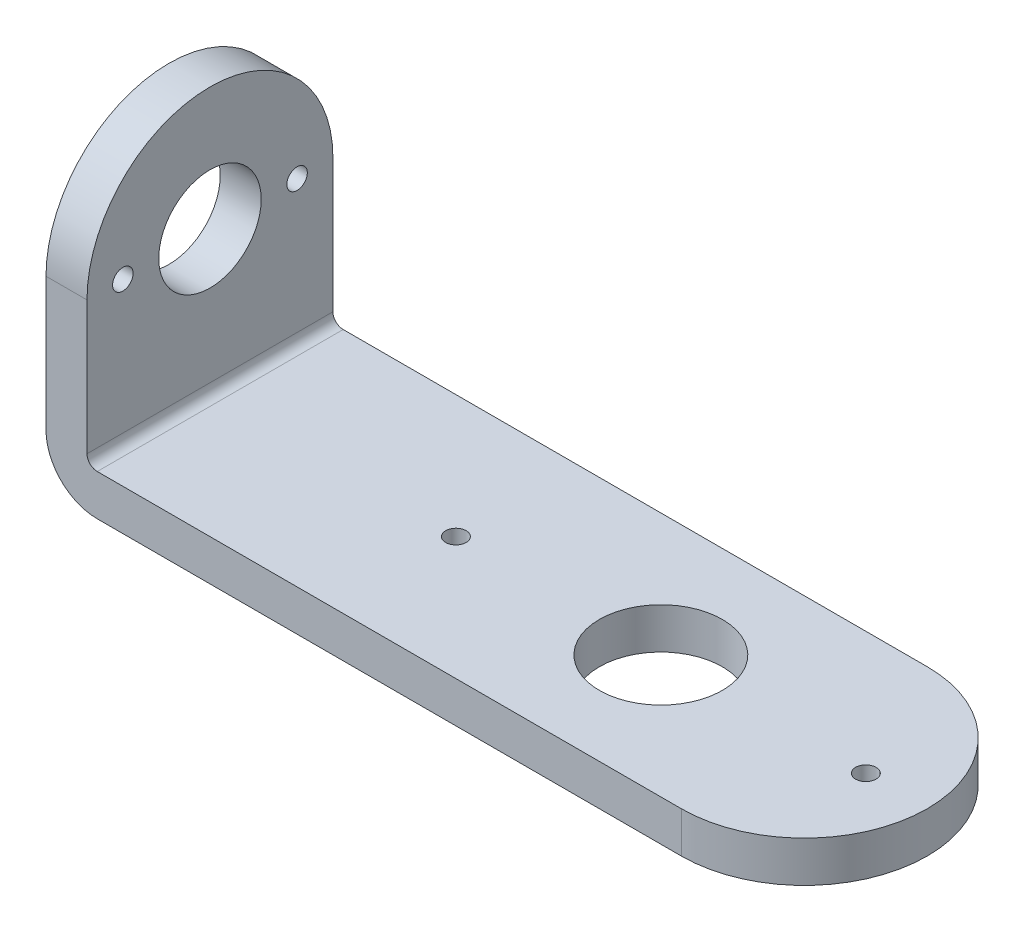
from build123d import *

# Parameters (mm, degrees)
EXTRU_MINCE1_DEPTH      = 6
ESQUISSE2_R             = 2.5
ESQUISSE2_R_2           = 0.5
ENL_V_MAT_EXTRU_1_DEPTH = 38.815340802
ESQUISSE3_R             = 0.5
ESQUISSE3_R_2           = 3
ENL_V_MAT_EXTRU_2_DEPTH = 40.67366885


with BuildPart() as part:
    # Esquisse1 → Extru.-Mince1 (new, symmetric)
    with BuildSketch(Plane.XY):
        with BuildLine():
            Line((0, 0), (-34.5, 0))
            ThreePointArc((-34.5, 0), (-34.853553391, 0.146446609), (-35, 0.5))
            Line((-35, 0.5), (-35, 13))
            Line((-35, 13), (-37, 13))
            Line((-37, 13), (-37, 0.5))
            ThreePointArc((-37, 0.5), (-36.267766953, -1.267766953), (-34.5, -2))
            Line((-34.5, -2), (0, -2))
            Line((0, -2), (0, 0))
        make_face()
    extrude(amount=EXTRU_MINCE1_DEPTH, both=True)

    # Esquisse2 → Enl_v. mat.-Extru.1 (cut, through all)
    with BuildSketch(Plane(origin=(-35, 0, 0), x_dir=(0, 0, -1), z_dir=(1, 0, 0))):
        with Locations((0, 7)):
            Circle(ESQUISSE2_R)
        with Locations((-4.25, 7)):
            Circle(ESQUISSE2_R_2)
        with Locations((4.25, 7)):
            Circle(ESQUISSE2_R_2)
        with BuildLine():
            Line((-6, 7), (-7.239014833, 7))
            Line((-7.239014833, 7), (-7.239014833, 14.759026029))
            Line((-7.239014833, 14.759026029), (7.171629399, 14.759026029))
            Line((7.171629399, 14.759026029), (7.171629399, 7))
            Line((7.171629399, 7), (6, 7))
            ThreePointArc((6, 7), (0, 13), (-6, 7))
        make_face()
    extrude(amount=-ENL_V_MAT_EXTRU_1_DEPTH, mode=Mode.SUBTRACT)

    # Esquisse3 → Enl_v. mat.-Extru.2 (cut, through all)
    with BuildSketch(Plane(origin=(0, 0, 0), x_dir=(-1, 0, 0), z_dir=(0, 1, 0))):
        with Locations((23, 0)):
            Circle(ESQUISSE3_R)
        with Locations((3, 0)):
            Circle(ESQUISSE3_R)
        with Locations((13, 0)):
            Circle(ESQUISSE3_R_2)
        with BuildLine():
            Line((6, 6), (6, 8.270106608))
            Line((6, 8.270106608), (-0.903544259, 8.270106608))
            Line((-0.903544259, 8.270106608), (-0.903544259, -8.097091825))
            Line((-0.903544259, -8.097091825), (6, -8.097091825))
            Line((6, -8.097091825), (6, -6))
            ThreePointArc((6, -6), (0, 0), (6, 6))
        make_face()
    extrude(amount=-ENL_V_MAT_EXTRU_2_DEPTH, mode=Mode.SUBTRACT)


solid = part.part
